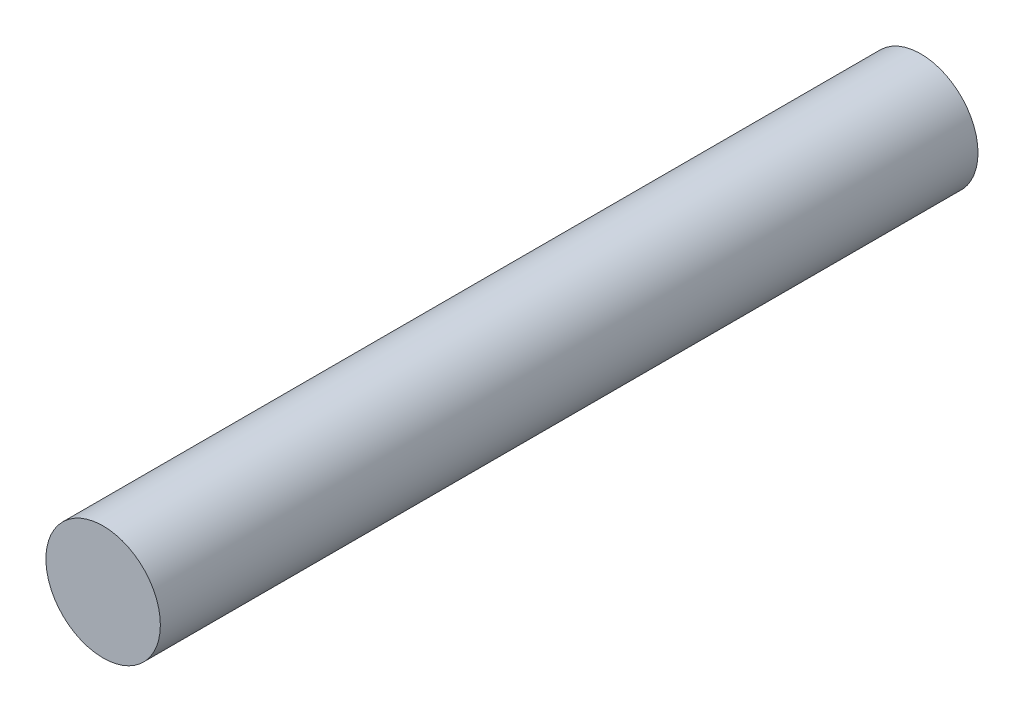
from build123d import *

# Parameters (mm, degrees)
SKETCH1_R           = 52.5
BOSS_EXTRUDE1_DEPTH = 750


with BuildPart() as part:
    # Sketch1 → Boss-Extrude1 (new body)
    with BuildSketch(Plane.XY):
        Circle(SKETCH1_R)
    extrude(amount=BOSS_EXTRUDE1_DEPTH)


solid = part.part
